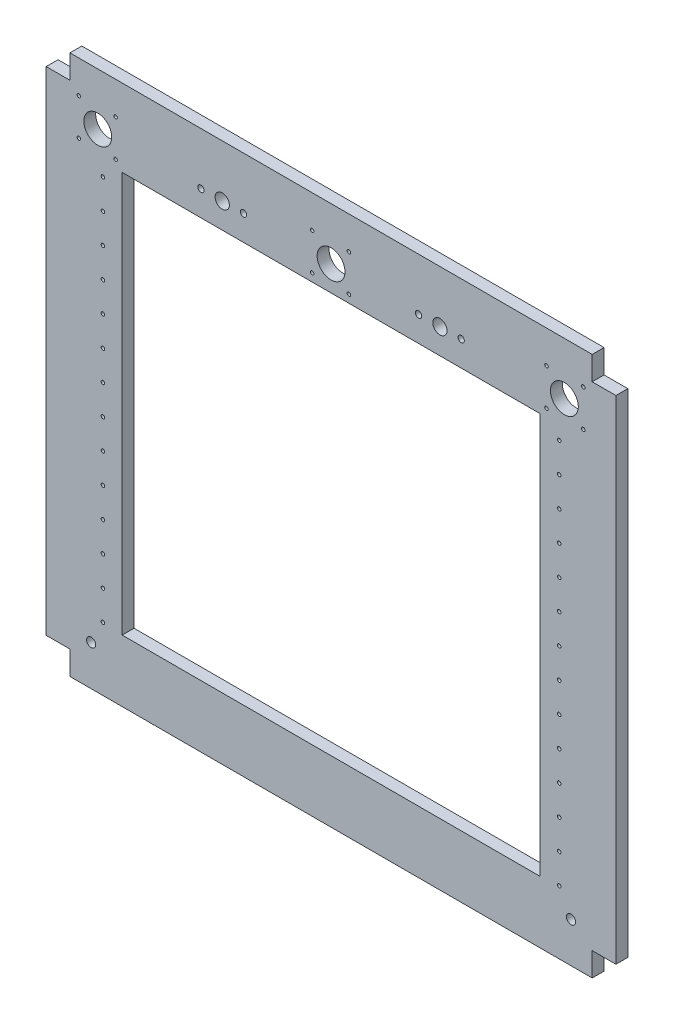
from build123d import *

# Parameters (mm, degrees)
SKETCH2_W           = 352
SKETCH2_H           = 337.6
BOSS_EXTRUDE1_DEPTH = 10
SKETCH4_R           = 11.75
SKETCH4_R_2         = 1.5
SKETCH4_R_3         = 2.65
SKETCH4_R_4         = 6
SKETCH4_R_5         = 3.85
CUT_EXTRUDE4_DEPTH  = 10
CUT_EXTRUDE3_DEPTH  = 10


with BuildPart() as part:
    # Sketch2 → Boss-Extrude1 (new body)
    with BuildSketch(Plane.XY):
        Polygon((-220, 227.5), (-220, 207.5), (-240, 207.5), (-240, -207.5), (-220, -207.5), (-220, -227.5), (220, -227.5), (220, -207.5), (240, -207.5), (240, 207.5), (220, 207.5), (220, 227.5), align=None)
        with Locations((0, -6.5)):
            Rectangle(SKETCH2_W, SKETCH2_H, mode=Mode.SUBTRACT)
    extrude(amount=BOSS_EXTRUDE1_DEPTH)

    # Sketch4 → Cut-Extrude4 (cut)
    with BuildSketch(Plane.XY.offset(10)):
        with Locations((-196.55, 183.55)):
            Circle(SKETCH4_R)
        with Locations((-181.5, 200)):
            Circle(SKETCH4_R_2)
        with Locations((-181.5, 169)):
            Circle(SKETCH4_R_2)
        with Locations((-212.5, 200)):
            Circle(SKETCH4_R_2)
        with Locations((-212.5, 169)):
            Circle(SKETCH4_R_2)
        with Locations(Location((196.55, 183.55, 0), (0, 0, 180))):
            Circle(SKETCH4_R)
        with Locations(Location((212.5, 169, 0), (0, 0, 180))):
            Circle(SKETCH4_R_2)
        with Locations(Location((181.5, 169, 0), (0, 0, 180))):
            Circle(SKETCH4_R_2)
        with Locations(Location((181.5, 200, 0), (0, 0, 180))):
            Circle(SKETCH4_R_2)
        with Locations(Location((212.5, 200, 0), (0, 0, 180))):
            Circle(SKETCH4_R_2)
        with Locations((0, 183.55)):
            Circle(SKETCH4_R)
        with Locations((-15.95, 200)):
            Circle(SKETCH4_R_2)
        with Locations((15.05, 200)):
            Circle(SKETCH4_R_2)
        with Locations((15.05, 169)):
            Circle(SKETCH4_R_2)
        with Locations((-15.95, 169)):
            Circle(SKETCH4_R_2)
        with Locations((-109.65, 183.55)):
            Circle(SKETCH4_R_3)
        with Locations((-91.7, 183.55)):
            Circle(SKETCH4_R_4)
        with Locations(Location((-73.75, 183.55, 0), (0, 0, 180))):
            Circle(SKETCH4_R_3)
        with Locations((73.75, 183.55)):
            Circle(SKETCH4_R_3)
        with Locations(Location((109.65, 183.55, 0), (0, 0, 180))):
            Circle(SKETCH4_R_3)
        with Locations(Location((91.7, 183.55, 0), (0, 0, 180))):
            Circle(SKETCH4_R_4)
        with Locations((-192.202807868, 150.886647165)):
            Circle(SKETCH4_R_2)
        with Locations((-192.202807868, 125.886647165)):
            Circle(SKETCH4_R_2)
        with Locations((-192.202807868, 100.886647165)):
            Circle(SKETCH4_R_2)
        with Locations((-192.202807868, 75.886647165)):
            Circle(SKETCH4_R_2)
        with Locations((-192.202807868, 50.886647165)):
            Circle(SKETCH4_R_2)
        with Locations((-192.202807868, 25.886647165)):
            Circle(SKETCH4_R_2)
        with Locations((-192.202807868, 0.886647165)):
            Circle(SKETCH4_R_2)
        with Locations((-192.202807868, -24.113352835)):
            Circle(SKETCH4_R_2)
        with Locations((-192.202807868, -49.113352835)):
            Circle(SKETCH4_R_2)
        with Locations((-192.202807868, -74.113352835)):
            Circle(SKETCH4_R_2)
        with Locations((-192.202807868, -99.113352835)):
            Circle(SKETCH4_R_2)
        with Locations((-192.202807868, -124.113352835)):
            Circle(SKETCH4_R_2)
        with Locations((-192.202807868, -149.113352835)):
            Circle(SKETCH4_R_2)
        with Locations((-192.202807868, -174.113352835)):
            Circle(SKETCH4_R_2)
        with Locations((-202.15, -193.65)):
            Circle(SKETCH4_R_5)
        with Locations(Location((202.15, -193.65, 0), (0, 0, 180))):
            Circle(SKETCH4_R_5)
        with Locations(Location((192.202807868, -174.113352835, 0), (0, 0, 180))):
            Circle(SKETCH4_R_2)
        with Locations(Location((192.202807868, -149.113352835, 0), (0, 0, 180))):
            Circle(SKETCH4_R_2)
        with Locations(Location((192.202807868, -124.113352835, 0), (0, 0, 180))):
            Circle(SKETCH4_R_2)
        with Locations(Location((192.202807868, -99.113352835, 0), (0, 0, 180))):
            Circle(SKETCH4_R_2)
        with Locations(Location((192.202807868, -74.113352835, 0), (0, 0, 180))):
            Circle(SKETCH4_R_2)
        with Locations(Location((192.202807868, -49.113352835, 0), (0, 0, 180))):
            Circle(SKETCH4_R_2)
        with Locations(Location((192.202807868, -24.113352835, 0), (0, 0, 180))):
            Circle(SKETCH4_R_2)
        with Locations(Location((192.202807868, 0.886647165, 0), (0, 0, 180))):
            Circle(SKETCH4_R_2)
        with Locations(Location((192.202807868, 25.886647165, 0), (0, 0, 180))):
            Circle(SKETCH4_R_2)
        with Locations(Location((192.202807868, 50.886647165, 0), (0, 0, 180))):
            Circle(SKETCH4_R_2)
        with Locations(Location((192.202807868, 75.886647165, 0), (0, 0, 180))):
            Circle(SKETCH4_R_2)
        with Locations(Location((192.202807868, 100.886647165, 0), (0, 0, 180))):
            Circle(SKETCH4_R_2)
        with Locations(Location((192.202807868, 125.886647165, 0), (0, 0, 180))):
            Circle(SKETCH4_R_2)
        with Locations(Location((192.202807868, 150.886647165, 0), (0, 0, 180))):
            Circle(SKETCH4_R_2)
    extrude(amount=-CUT_EXTRUDE4_DEPTH, mode=Mode.SUBTRACT)

    # Sketch4 → Cut-Extrude3 (cut)
    with BuildSketch(Plane.XY.offset(10)):
        with Locations((-196.55, 183.55)):
            Circle(SKETCH4_R)
        with Locations((-181.5, 200)):
            Circle(SKETCH4_R_2)
        with Locations((-181.5, 169)):
            Circle(SKETCH4_R_2)
        with Locations((-212.5, 200)):
            Circle(SKETCH4_R_2)
        with Locations((-212.5, 169)):
            Circle(SKETCH4_R_2)
        with Locations(Location((196.55, 183.55, 0), (0, 0, 180))):
            Circle(SKETCH4_R)
        with Locations(Location((212.5, 169, 0), (0, 0, 180))):
            Circle(SKETCH4_R_2)
        with Locations(Location((181.5, 169, 0), (0, 0, 180))):
            Circle(SKETCH4_R_2)
        with Locations(Location((181.5, 200, 0), (0, 0, 180))):
            Circle(SKETCH4_R_2)
        with Locations(Location((212.5, 200, 0), (0, 0, 180))):
            Circle(SKETCH4_R_2)
        with Locations((0, 183.55)):
            Circle(SKETCH4_R)
        with Locations((-15.95, 200)):
            Circle(SKETCH4_R_2)
        with Locations((15.05, 200)):
            Circle(SKETCH4_R_2)
        with Locations((15.05, 169)):
            Circle(SKETCH4_R_2)
        with Locations((-15.95, 169)):
            Circle(SKETCH4_R_2)
        with Locations((-109.65, 183.55)):
            Circle(SKETCH4_R_3)
        with Locations((-91.7, 183.55)):
            Circle(SKETCH4_R_4)
        with Locations(Location((-73.75, 183.55, 0), (0, 0, 180))):
            Circle(SKETCH4_R_3)
        with Locations((73.75, 183.55)):
            Circle(SKETCH4_R_3)
        with Locations(Location((109.65, 183.55, 0), (0, 0, 180))):
            Circle(SKETCH4_R_3)
        with Locations(Location((91.7, 183.55, 0), (0, 0, 180))):
            Circle(SKETCH4_R_4)
        with Locations((-192.202807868, 150.886647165)):
            Circle(SKETCH4_R_2)
        with Locations((-192.202807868, 125.886647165)):
            Circle(SKETCH4_R_2)
        with Locations((-192.202807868, 100.886647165)):
            Circle(SKETCH4_R_2)
        with Locations((-192.202807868, 75.886647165)):
            Circle(SKETCH4_R_2)
        with Locations((-192.202807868, 50.886647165)):
            Circle(SKETCH4_R_2)
        with Locations((-192.202807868, 25.886647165)):
            Circle(SKETCH4_R_2)
        with Locations((-192.202807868, 0.886647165)):
            Circle(SKETCH4_R_2)
        with Locations((-192.202807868, -24.113352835)):
            Circle(SKETCH4_R_2)
        with Locations((-192.202807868, -49.113352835)):
            Circle(SKETCH4_R_2)
        with Locations((-192.202807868, -74.113352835)):
            Circle(SKETCH4_R_2)
        with Locations((-192.202807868, -99.113352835)):
            Circle(SKETCH4_R_2)
        with Locations((-192.202807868, -124.113352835)):
            Circle(SKETCH4_R_2)
        with Locations((-192.202807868, -149.113352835)):
            Circle(SKETCH4_R_2)
        with Locations((-192.202807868, -174.113352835)):
            Circle(SKETCH4_R_2)
        with Locations((-202.15, -193.65)):
            Circle(SKETCH4_R_5)
        with Locations(Location((202.15, -193.65, 0), (0, 0, 180))):
            Circle(SKETCH4_R_5)
        with Locations(Location((192.202807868, -174.113352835, 0), (0, 0, 180))):
            Circle(SKETCH4_R_2)
        with Locations(Location((192.202807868, -149.113352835, 0), (0, 0, 180))):
            Circle(SKETCH4_R_2)
        with Locations(Location((192.202807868, -124.113352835, 0), (0, 0, 180))):
            Circle(SKETCH4_R_2)
        with Locations(Location((192.202807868, -99.113352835, 0), (0, 0, 180))):
            Circle(SKETCH4_R_2)
        with Locations(Location((192.202807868, -74.113352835, 0), (0, 0, 180))):
            Circle(SKETCH4_R_2)
        with Locations(Location((192.202807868, -49.113352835, 0), (0, 0, 180))):
            Circle(SKETCH4_R_2)
        with Locations(Location((192.202807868, -24.113352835, 0), (0, 0, 180))):
            Circle(SKETCH4_R_2)
        with Locations(Location((192.202807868, 0.886647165, 0), (0, 0, 180))):
            Circle(SKETCH4_R_2)
        with Locations(Location((192.202807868, 25.886647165, 0), (0, 0, 180))):
            Circle(SKETCH4_R_2)
        with Locations(Location((192.202807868, 50.886647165, 0), (0, 0, 180))):
            Circle(SKETCH4_R_2)
        with Locations(Location((192.202807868, 75.886647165, 0), (0, 0, 180))):
            Circle(SKETCH4_R_2)
        with Locations(Location((192.202807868, 100.886647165, 0), (0, 0, 180))):
            Circle(SKETCH4_R_2)
        with Locations(Location((192.202807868, 125.886647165, 0), (0, 0, 180))):
            Circle(SKETCH4_R_2)
        with Locations(Location((192.202807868, 150.886647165, 0), (0, 0, 180))):
            Circle(SKETCH4_R_2)
    extrude(amount=-CUT_EXTRUDE3_DEPTH, mode=Mode.SUBTRACT)


solid = part.part
